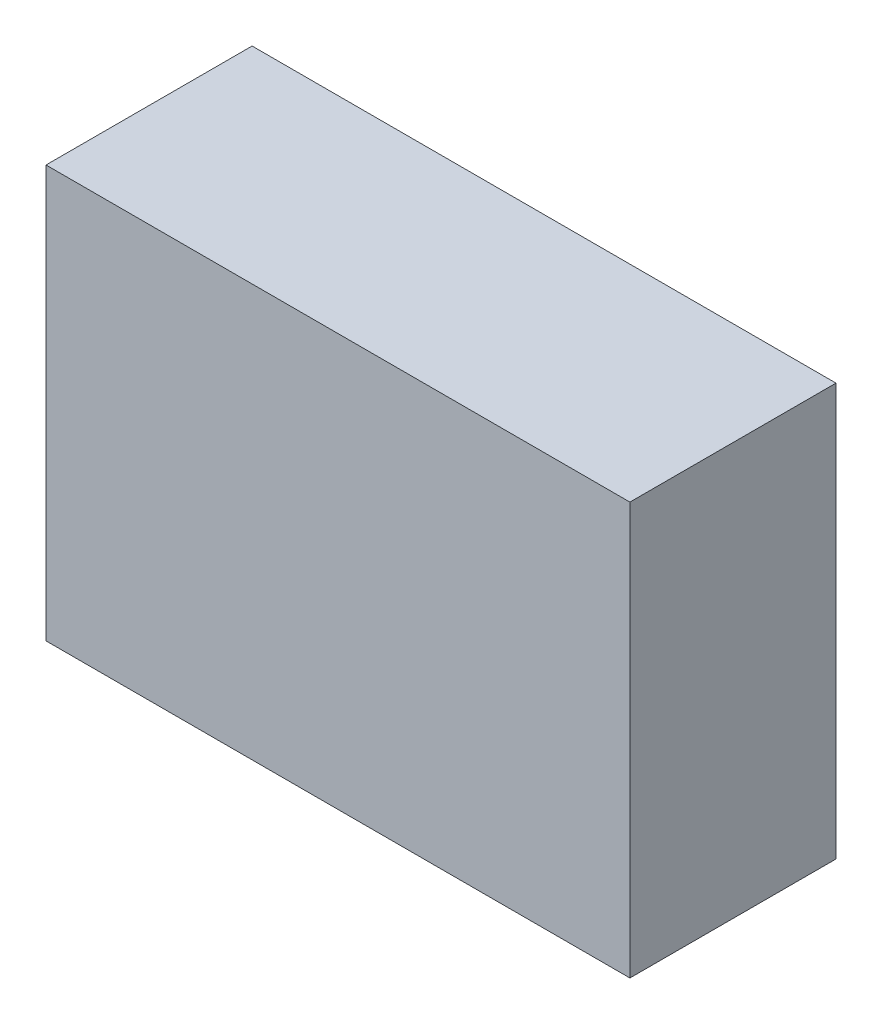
from build123d import *

# Parameters (mm, degrees)
ESQUISSE2_W     = 85
ESQUISSE2_H     = 60
BOITIER_1_DEPTH = 30


with BuildPart() as part:
    # Esquisse2 → Boitier 1 (new body)
    with BuildSketch(Plane.XY):
        Rectangle(ESQUISSE2_W, ESQUISSE2_H)
    extrude(amount=-BOITIER_1_DEPTH)


solid = part.part
